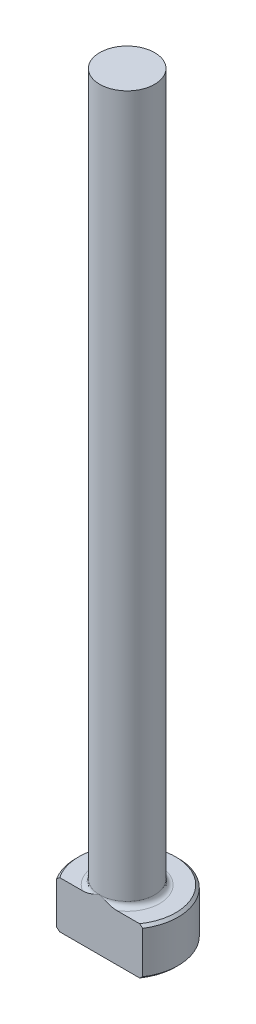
ISO-10303-21;
HEADER;
FILE_DESCRIPTION(('STEP AP214'),'2;1');
FILE_NAME('part.step','',(''),(''),'','','');
FILE_SCHEMA(('AUTOMOTIVE_DESIGN { 1 0 10303 214 1 1 1 1 }'));
ENDSEC;
DATA;
#1=APPLICATION_CONTEXT('core data for automotive mechanical design processes');
#2=APPLICATION_PROTOCOL_DEFINITION('international standard','automotive_design',2000,#1);
#3=PRODUCT_CONTEXT('',#1,'mechanical');
#4=PRODUCT('Part','Part','',(#3));
#5=PRODUCT_RELATED_PRODUCT_CATEGORY('part','',(#4));
#6=PRODUCT_DEFINITION_FORMATION('','',#4);
#7=PRODUCT_DEFINITION_CONTEXT('part definition',#1,'design');
#8=PRODUCT_DEFINITION('design','',#6,#7);
#9=PRODUCT_DEFINITION_SHAPE('','',#8);
#10=(LENGTH_UNIT() NAMED_UNIT(*) SI_UNIT(.MILLI.,.METRE.));
#11=(NAMED_UNIT(*) PLANE_ANGLE_UNIT() SI_UNIT($,.RADIAN.));
#12=(NAMED_UNIT(*) SI_UNIT($,.STERADIAN.) SOLID_ANGLE_UNIT());
#13=UNCERTAINTY_MEASURE_WITH_UNIT(LENGTH_MEASURE(1.E-05),#10,'distance_accuracy_value','');
#14=(GEOMETRIC_REPRESENTATION_CONTEXT(3) GLOBAL_UNCERTAINTY_ASSIGNED_CONTEXT((#13)) GLOBAL_UNIT_ASSIGNED_CONTEXT((#10,
#11,#12)) REPRESENTATION_CONTEXT('',''));
#15=CARTESIAN_POINT('',(0.,0.,0.));
#16=DIRECTION('',(0.,0.,1.));
#17=DIRECTION('',(1.,0.,0.));
#18=AXIS2_PLACEMENT_3D('',#15,#16,#17);
#19=CARTESIAN_POINT('',(0.,0.,0.));
#20=DIRECTION('',(0.,-1.,0.));
#21=DIRECTION('',(0.,0.,-1.));
#22=AXIS2_PLACEMENT_3D('',#19,#20,#21);
#23=PLANE('',#22);
#24=CARTESIAN_POINT('',(0.,0.,0.));
#25=DIRECTION('',(0.,-1.,0.));
#26=DIRECTION('',(0.,0.,-1.));
#27=AXIS2_PLACEMENT_3D('',#24,#25,#26);
#28=CIRCLE('',#27,4.90219999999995);
#29=CARTESIAN_POINT('',(-4.03944478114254,0.,2.77748999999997));
#30=VERTEX_POINT('',#29);
#31=CARTESIAN_POINT('',(4.03944478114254,0.,2.77748999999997));
#32=VERTEX_POINT('',#31);
#33=EDGE_CURVE('E98',#30,#32,#28,.T.);
#34=ORIENTED_EDGE('',*,*,#33,.T.);
#35=DIRECTION('',(-1.,0.,0.));
#36=VECTOR('',#35,1.);
#37=CARTESIAN_POINT('',(-4.34418550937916,0.,2.77748999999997));
#38=LINE('',#37,#36);
#39=EDGE_CURVE('E83',#32,#30,#38,.T.);
#40=ORIENTED_EDGE('',*,*,#39,.T.);
#41=EDGE_LOOP('',(#34,#40));
#42=FACE_BOUND('',#41,.T.);
#43=ADVANCED_FACE('F32',(#42),#23,.T.);
#44=CARTESIAN_POINT('',(0.,259.958771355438,0.));
#45=DIRECTION('',(0.,1.,0.));
#46=DIRECTION('',(0.,0.,1.));
#47=AXIS2_PLACEMENT_3D('',#44,#45,#46);
#48=CYLINDRICAL_SURFACE('',#47,5.15619999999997);
#49=CARTESIAN_POINT('',(0.,4.49579999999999,0.));
#50=DIRECTION('',(0.,1.,0.));
#51=DIRECTION('',(0.,0.,1.));
#52=AXIS2_PLACEMENT_3D('',#49,#50,#51);
#53=CIRCLE('',#52,5.15619999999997);
#54=CARTESIAN_POINT('',(-4.34418550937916,4.49579999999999,2.77748999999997));
#55=VERTEX_POINT('',#54);
#56=CARTESIAN_POINT('',(4.34418550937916,4.49579999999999,2.77748999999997));
#57=VERTEX_POINT('',#56);
#58=EDGE_CURVE('E104',#55,#57,#53,.F.);
#59=ORIENTED_EDGE('',*,*,#58,.T.);
#60=DIRECTION('',(0.,-1.,0.));
#61=VECTOR('',#60,1.);
#62=CARTESIAN_POINT('',(4.34418550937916,76.2,2.77748999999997));
#63=LINE('',#62,#61);
#64=CARTESIAN_POINT('',(4.34418550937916,0.254000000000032,2.77748999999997));
#65=VERTEX_POINT('',#64);
#66=EDGE_CURVE('E183',#57,#65,#63,.T.);
#67=ORIENTED_EDGE('',*,*,#66,.T.);
#68=CARTESIAN_POINT('',(0.,0.254000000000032,0.));
#69=DIRECTION('',(0.,-1.,0.));
#70=DIRECTION('',(0.,0.,-1.));
#71=AXIS2_PLACEMENT_3D('',#68,#69,#70);
#72=CIRCLE('',#71,5.15619999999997);
#73=CARTESIAN_POINT('',(-4.34418550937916,0.254000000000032,2.77748999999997));
#74=VERTEX_POINT('',#73);
#75=EDGE_CURVE('E100',#65,#74,#72,.F.);
#76=ORIENTED_EDGE('',*,*,#75,.T.);
#77=DIRECTION('',(0.,-1.,0.));
#78=VECTOR('',#77,1.);
#79=CARTESIAN_POINT('',(-4.34418550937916,76.2,2.77748999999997));
#80=LINE('',#79,#78);
#81=EDGE_CURVE('E93',#55,#74,#80,.T.);
#82=ORIENTED_EDGE('',*,*,#81,.F.);
#83=EDGE_LOOP('',(#59,#67,#76,#82));
#84=FACE_BOUND('',#83,.T.);
#85=ADVANCED_FACE('F158',(#84),#48,.T.);
#86=CARTESIAN_POINT('',(-5.15619999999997,4.7498,0.));
#87=DIRECTION('',(0.,1.,0.));
#88=DIRECTION('',(0.,0.,1.));
#89=AXIS2_PLACEMENT_3D('',#86,#87,#88);
#90=PLANE('',#89);
#91=CARTESIAN_POINT('',(0.,4.7498,0.));
#92=DIRECTION('',(0.,1.,0.));
#93=DIRECTION('',(0.,0.,1.));
#94=AXIS2_PLACEMENT_3D('',#91,#92,#93);
#95=CIRCLE('',#94,4.90220000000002);
#96=CARTESIAN_POINT('',(4.03944478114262,4.7498,2.77748999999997));
#97=VERTEX_POINT('',#96);
#98=CARTESIAN_POINT('',(-4.03944478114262,4.7498,2.77748999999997));
#99=VERTEX_POINT('',#98);
#100=EDGE_CURVE('E178',#97,#99,#95,.T.);
#101=ORIENTED_EDGE('',*,*,#100,.T.);
#102=DIRECTION('',(1.,0.,0.));
#103=VECTOR('',#102,1.);
#104=CARTESIAN_POINT('',(-5.15619999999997,4.7498,2.77748999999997));
#105=LINE('',#104,#103);
#106=CARTESIAN_POINT('',(-1.75499112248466,4.74979999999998,2.77748999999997));
#107=VERTEX_POINT('',#106);
#108=EDGE_CURVE('E57',#99,#107,#105,.T.);
#109=ORIENTED_EDGE('',*,*,#108,.T.);
#110=CARTESIAN_POINT('',(0.,4.7498,0.));
#111=DIRECTION('',(0.,1.,0.));
#112=DIRECTION('',(0.,0.,1.));
#113=AXIS2_PLACEMENT_3D('',#110,#111,#112);
#114=CIRCLE('',#113,3.28548999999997);
#115=CARTESIAN_POINT('',(1.75499112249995,4.74979999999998,2.77748999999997));
#116=VERTEX_POINT('',#115);
#117=EDGE_CURVE('E107',#107,#116,#114,.F.);
#118=ORIENTED_EDGE('',*,*,#117,.T.);
#119=EDGE_CURVE('E136',#116,#97,#105,.T.);
#120=ORIENTED_EDGE('',*,*,#119,.T.);
#121=EDGE_LOOP('',(#101,#109,#118,#120));
#122=FACE_BOUND('',#121,.T.);
#123=ADVANCED_FACE('F147',(#122),#90,.T.);
#124=CARTESIAN_POINT('',(0.,4.74980000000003,0.));
#125=DIRECTION('',(0.,-1.,0.));
#126=DIRECTION('',(0.,0.,-1.));
#127=AXIS2_PLACEMENT_3D('',#124,#125,#126);
#128=CONICAL_SURFACE('',#127,4.90219999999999,0.785398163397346);
#129=ORIENTED_EDGE('',*,*,#58,.F.);
#130=CARTESIAN_POINT('',(-9.55963531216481,-0.302952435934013,2.77748999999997));
#131=CARTESIAN_POINT('',(-9.37135034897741,-0.122152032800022,2.77748999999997));
#132=CARTESIAN_POINT('',(-9.18286469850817,0.0584399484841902,2.77748999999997));
#133=CARTESIAN_POINT('',(-8.80539641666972,0.419106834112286,2.77748999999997));
#134=CARTESIAN_POINT('',(-8.61641378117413,0.599181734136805,2.77748999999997));
#135=CARTESIAN_POINT('',(-8.23780363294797,0.958763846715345,2.77748999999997));
#136=CARTESIAN_POINT('',(-8.04817594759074,1.13827087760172,2.77748999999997));
#137=CARTESIAN_POINT('',(-7.66820393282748,1.49652400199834,2.77748999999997));
#138=CARTESIAN_POINT('',(-7.47785960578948,1.67527009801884,2.77748999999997));
#139=CARTESIAN_POINT('',(-7.09861750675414,2.02964380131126,2.77748999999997));
#140=CARTESIAN_POINT('',(-6.90973042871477,2.20528284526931,2.77748999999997));
#141=CARTESIAN_POINT('',(-6.53088645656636,2.55540305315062,2.77748999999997));
#142=CARTESIAN_POINT('',(-6.34092956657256,2.72988422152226,2.77748999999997));
#143=CARTESIAN_POINT('',(-5.9596856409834,3.07734070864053,2.77748999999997));
#144=CARTESIAN_POINT('',(-5.76839877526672,3.25031621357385,2.77748999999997));
#145=CARTESIAN_POINT('',(-5.38408554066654,3.59432147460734,2.77748999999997));
#146=CARTESIAN_POINT('',(-5.1910592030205,3.76535126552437,2.77748999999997));
#147=CARTESIAN_POINT('',(-4.84259460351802,4.06992471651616,2.77748999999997));
#148=CARTESIAN_POINT('',(-4.68757975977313,4.20395211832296,2.77748999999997));
#149=CARTESIAN_POINT('',(-4.37569692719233,4.4698650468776,2.77748999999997));
#150=CARTESIAN_POINT('',(-4.2188287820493,4.60175039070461,2.77748999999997));
#151=CARTESIAN_POINT('',(-3.90151974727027,4.86365914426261,2.77748999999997));
#152=CARTESIAN_POINT('',(-3.74106073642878,4.99366069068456,2.77748999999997));
#153=CARTESIAN_POINT('',(-3.41702456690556,5.24965567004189,2.77748999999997));
#154=CARTESIAN_POINT('',(-3.25344811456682,5.37564999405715,2.77748999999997));
#155=CARTESIAN_POINT('',(-2.92018078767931,5.62344221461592,2.77748999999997));
#156=CARTESIAN_POINT('',(-2.75044139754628,5.74517569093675,2.77748999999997));
#157=CARTESIAN_POINT('',(-2.49133655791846,5.92141891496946,2.77748999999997));
#158=CARTESIAN_POINT('',(-2.40416054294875,5.97914279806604,2.77748999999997));
#159=CARTESIAN_POINT('',(-2.22809424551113,6.09190571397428,2.77748999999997));
#160=CARTESIAN_POINT('',(-2.13920410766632,6.14694497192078,2.77748999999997));
#161=CARTESIAN_POINT('',(-1.96016003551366,6.25324529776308,2.77748999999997));
#162=CARTESIAN_POINT('',(-1.8700225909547,6.3045338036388,2.77748999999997));
#163=CARTESIAN_POINT('',(-1.68751963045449,6.40295882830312,2.77748999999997));
#164=CARTESIAN_POINT('',(-1.59515373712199,6.45009463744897,2.77748999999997));
#165=CARTESIAN_POINT('',(-1.31465582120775,6.58349576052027,2.77748999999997));
#166=CARTESIAN_POINT('',(-1.12257968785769,6.66209225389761,2.77748999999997));
#167=CARTESIAN_POINT('',(-0.832011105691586,6.75391692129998,2.77748999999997));
#168=CARTESIAN_POINT('',(-0.737496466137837,6.77977348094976,2.77748999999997));
#169=CARTESIAN_POINT('',(-0.546475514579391,6.82278925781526,2.77748999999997));
#170=CARTESIAN_POINT('',(-0.44996950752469,6.83994979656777,2.77748999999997));
#171=CARTESIAN_POINT('',(-0.256218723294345,6.86436233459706,2.77748999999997));
#172=CARTESIAN_POINT('',(-0.158980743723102,6.87166730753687,2.77748999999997));
#173=CARTESIAN_POINT('',(0.0357279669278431,6.87598550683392,2.77748999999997));
#174=CARTESIAN_POINT('',(0.133198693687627,6.87299892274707,2.77748999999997));
#175=CARTESIAN_POINT('',(0.326944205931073,6.85699585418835,2.77748999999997));
#176=CARTESIAN_POINT('',(0.423222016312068,6.84401516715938,2.77748999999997));
#177=CARTESIAN_POINT('',(0.614119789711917,6.8089777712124,2.77748999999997));
#178=CARTESIAN_POINT('',(0.708739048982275,6.78691730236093,2.77748999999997));
#179=CARTESIAN_POINT('',(0.896435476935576,6.73483507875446,2.77748999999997));
#180=CARTESIAN_POINT('',(0.989497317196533,6.70475895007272,2.77748999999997));
#181=CARTESIAN_POINT('',(1.17322201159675,6.63810376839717,2.77748999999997));
#182=CARTESIAN_POINT('',(1.26388499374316,6.60152506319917,2.77748999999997));
#183=CARTESIAN_POINT('',(1.47746511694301,6.50797532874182,2.77748999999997));
#184=CARTESIAN_POINT('',(1.59931597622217,6.44858460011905,2.77748999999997));
#185=CARTESIAN_POINT('',(1.83913088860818,6.3223671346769,2.77748999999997));
#186=CARTESIAN_POINT('',(1.95709243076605,6.25553571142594,2.77748999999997));
#187=CARTESIAN_POINT('',(2.18997865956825,6.11622068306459,2.77748999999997));
#188=CARTESIAN_POINT('',(2.30489556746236,6.04372417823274,2.77748999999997));
#189=CARTESIAN_POINT('',(2.53196606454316,5.89460998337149,2.77748999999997));
#190=CARTESIAN_POINT('',(2.64412028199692,5.81799324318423,2.77748999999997));
#191=CARTESIAN_POINT('',(2.86729042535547,5.66082623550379,2.77748999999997));
#192=CARTESIAN_POINT('',(2.97828414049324,5.5802445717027,2.77748999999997));
#193=CARTESIAN_POINT('',(3.19840564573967,5.41657181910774,2.77748999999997));
#194=CARTESIAN_POINT('',(3.30753335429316,5.33348062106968,2.77748999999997));
#195=CARTESIAN_POINT('',(3.63230478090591,5.08151517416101,2.77748999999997));
#196=CARTESIAN_POINT('',(3.84567050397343,4.90970900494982,2.77748999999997));
#197=CARTESIAN_POINT('',(4.30277208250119,4.53251833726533,2.77748999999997));
#198=CARTESIAN_POINT('',(4.54576364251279,4.32624002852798,2.77748999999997));
#199=CARTESIAN_POINT('',(5.0278968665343,3.90921091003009,2.77748999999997));
#200=CARTESIAN_POINT('',(5.26703820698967,3.69845972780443,2.77748999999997));
#201=CARTESIAN_POINT('',(5.74277905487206,3.27371644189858,2.77748999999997));
#202=CARTESIAN_POINT('',(5.97937625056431,3.0597217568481,2.77748999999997));
#203=CARTESIAN_POINT('',(6.45056510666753,2.62953458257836,2.77748999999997));
#204=CARTESIAN_POINT('',(6.68515674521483,2.41334206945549,2.77748999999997));
#205=CARTESIAN_POINT('',(7.14123520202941,1.99009092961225,2.77748999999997));
#206=CARTESIAN_POINT('',(7.36279506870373,1.78311090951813,2.77748999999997));
#207=CARTESIAN_POINT('',(7.80485250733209,1.36801517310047,2.77748999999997));
#208=CARTESIAN_POINT('',(8.02535006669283,1.15989944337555,2.77748999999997));
#209=CARTESIAN_POINT('',(8.46520134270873,0.743063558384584,2.77748999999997));
#210=CARTESIAN_POINT('',(8.68455621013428,0.534344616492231,2.77748999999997));
#211=CARTESIAN_POINT('',(9.12257454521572,0.116191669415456,2.77748999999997));
#212=CARTESIAN_POINT('',(9.34123802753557,-0.0932423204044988,2.77748999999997));
#213=CARTESIAN_POINT('',(9.55963531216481,-0.302952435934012,2.77748999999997));
#214=B_SPLINE_CURVE_WITH_KNOTS('',3,(#130,#131,#132,#133,#134,#135,#136,#137,#138,#139,#140,
#141,#142,#143,#144,#145,#146,#147,#148,#149,#150,#151,#152,#153,#154,#155,#156,#157,#158,#159,
#160,#161,#162,#163,#164,#165,#166,#167,#168,#169,#170,#171,#172,#173,#174,#175,#176,#177,#178,
#179,#180,#181,#182,#183,#184,#185,#186,#187,#188,#189,#190,#191,#192,#193,#194,#195,#196,#197,
#198,#199,#200,#201,#202,#203,#204,#205,#206,#207,#208,#209,#210,#211,#212,#213),.UNSPECIFIED.,
.F.,.F.,(4,2,2,2,2,2,2,2,2,2,2,2,2,2,2,2,2,2,2,2,2,2,2,2,2,2,2,2,2,2,2,2,2,2,2,2,2,2,2,2,2,4),
(0.,0.783109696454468,1.56622591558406,2.34957144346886,3.13291438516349,3.90669782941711,
4.68047829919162,5.45416168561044,6.2278312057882,6.84258177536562,7.45738456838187,
8.07687494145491,8.69622658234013,9.32265693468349,9.63628229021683,9.94988129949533,
10.260891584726,10.5719549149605,11.1921677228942,11.4858060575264,11.7793997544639,
12.0714090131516,12.3634128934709,12.6543756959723,12.9454591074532,13.2385696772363,
13.5316645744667,13.9379559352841,14.3445046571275,14.7520077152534,15.1594172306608,
15.570853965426,15.9823086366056,16.8039855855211,17.760133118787,18.716360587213,
19.6733938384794,20.6304375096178,21.540028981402,22.4496312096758,23.3579913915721,
24.2663321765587),.UNSPECIFIED.);
#215=EDGE_CURVE('E135',#55,#99,#214,.T.);
#216=ORIENTED_EDGE('',*,*,#215,.T.);
#217=ORIENTED_EDGE('',*,*,#100,.F.);
#218=EDGE_CURVE('E127',#97,#57,#214,.T.);
#219=ORIENTED_EDGE('',*,*,#218,.T.);
#220=EDGE_LOOP('',(#129,#216,#217,#219));
#221=FACE_BOUND('',#220,.T.);
#222=ADVANCED_FACE('F143',(#221),#128,.T.);
#223=CARTESIAN_POINT('',(0.,0.254000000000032,0.));
#224=DIRECTION('',(0.,1.,0.));
#225=DIRECTION('',(0.,0.,1.));
#226=AXIS2_PLACEMENT_3D('',#223,#224,#225);
#227=CONICAL_SURFACE('',#226,5.15619999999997,0.785398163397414);
#228=ORIENTED_EDGE('',*,*,#75,.F.);
#229=CARTESIAN_POINT('',(9.55963531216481,5.05275243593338,2.77748999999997));
#230=CARTESIAN_POINT('',(9.37135034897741,4.87195203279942,2.77748999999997));
#231=CARTESIAN_POINT('',(9.18286469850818,4.69136005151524,2.77748999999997));
#232=CARTESIAN_POINT('',(8.80539641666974,4.3306931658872,2.77748999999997));
#233=CARTESIAN_POINT('',(8.61641378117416,4.15061826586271,2.77748999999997));
#234=CARTESIAN_POINT('',(8.237803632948,3.79103615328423,2.77748999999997));
#235=CARTESIAN_POINT('',(8.04817594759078,3.61152912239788,2.77748999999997));
#236=CARTESIAN_POINT('',(7.66820393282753,3.25327599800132,2.77748999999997));
#237=CARTESIAN_POINT('',(7.47785960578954,3.07452990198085,2.77748999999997));
#238=CARTESIAN_POINT('',(7.09861750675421,2.72015619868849,2.77748999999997));
#239=CARTESIAN_POINT('',(6.90973042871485,2.54451715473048,2.77748999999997));
#240=CARTESIAN_POINT('',(6.53088645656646,2.19439694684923,2.77748999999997));
#241=CARTESIAN_POINT('',(6.34092956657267,2.01991577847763,2.77748999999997));
#242=CARTESIAN_POINT('',(5.95968564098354,1.67245929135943,2.77748999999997));
#243=CARTESIAN_POINT('',(5.76839877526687,1.49948378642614,2.77748999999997));
#244=CARTESIAN_POINT('',(5.38408554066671,1.15547852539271,2.77748999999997));
#245=CARTESIAN_POINT('',(5.19105920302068,0.98444873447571,2.77748999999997));
#246=CARTESIAN_POINT('',(4.84259460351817,0.679875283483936,2.77748999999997));
#247=CARTESIAN_POINT('',(4.68757975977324,0.545847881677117,2.77748999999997));
#248=CARTESIAN_POINT('',(4.37569692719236,0.279934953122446,2.77748999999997));
#249=CARTESIAN_POINT('',(4.21882878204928,0.148049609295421,2.77748999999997));
#250=CARTESIAN_POINT('',(3.90151974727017,-0.113859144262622,2.77748999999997));
#251=CARTESIAN_POINT('',(3.74106073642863,-0.243860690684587,2.77748999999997));
#252=CARTESIAN_POINT('',(3.41702456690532,-0.499855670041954,2.77748999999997));
#253=CARTESIAN_POINT('',(3.25344811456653,-0.625849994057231,2.77748999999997));
#254=CARTESIAN_POINT('',(2.92018078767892,-0.87364221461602,2.77748999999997));
#255=CARTESIAN_POINT('',(2.75044139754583,-0.995375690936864,2.77748999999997));
#256=CARTESIAN_POINT('',(2.49133655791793,-1.17161891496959,2.77748999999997));
#257=CARTESIAN_POINT('',(2.40416054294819,-1.22934279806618,2.77748999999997));
#258=CARTESIAN_POINT('',(2.22809424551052,-1.34210571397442,2.77748999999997));
#259=CARTESIAN_POINT('',(2.13920410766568,-1.39714497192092,2.77748999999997));
#260=CARTESIAN_POINT('',(1.96016003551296,-1.50344529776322,2.77748999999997));
#261=CARTESIAN_POINT('',(1.87002259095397,-1.55473380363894,2.77748999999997));
#262=CARTESIAN_POINT('',(1.6875196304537,-1.65315882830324,2.77748999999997));
#263=CARTESIAN_POINT('',(1.59515373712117,-1.70029463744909,2.77748999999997));
#264=CARTESIAN_POINT('',(1.31465582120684,-1.83369576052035,2.77748999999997));
#265=CARTESIAN_POINT('',(1.12257968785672,-1.91229225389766,2.77748999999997));
#266=CARTESIAN_POINT('',(0.832011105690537,-2.00411692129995,2.77748999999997));
#267=CARTESIAN_POINT('',(0.73749646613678,-2.02997348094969,2.77748999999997));
#268=CARTESIAN_POINT('',(0.546475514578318,-2.07298925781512,2.77748999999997));
#269=CARTESIAN_POINT('',(0.449969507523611,-2.0901497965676,2.77748999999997));
#270=CARTESIAN_POINT('',(0.256218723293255,-2.11456233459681,2.77748999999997));
#271=CARTESIAN_POINT('',(0.158980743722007,-2.12186730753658,2.77748999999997));
#272=CARTESIAN_POINT('',(-0.0357279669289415,-2.12618550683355,2.77748999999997));
#273=CARTESIAN_POINT('',(-0.133198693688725,-2.12319892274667,2.77748999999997));
#274=CARTESIAN_POINT('',(-0.326944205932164,-2.10719585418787,2.77748999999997));
#275=CARTESIAN_POINT('',(-0.423222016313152,-2.09421516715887,2.77748999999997));
#276=CARTESIAN_POINT('',(-0.614119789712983,-2.05917777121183,2.77748999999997));
#277=CARTESIAN_POINT('',(-0.708739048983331,-2.03711730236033,2.77748999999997));
#278=CARTESIAN_POINT('',(-0.896435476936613,-1.98503507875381,2.77748999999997));
#279=CARTESIAN_POINT('',(-0.98949731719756,-1.95495895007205,2.77748999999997));
#280=CARTESIAN_POINT('',(-1.17322201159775,-1.88830376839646,2.77748999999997));
#281=CARTESIAN_POINT('',(-1.26388499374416,-1.85172506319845,2.77748999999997));
#282=CARTESIAN_POINT('',(-1.47746511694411,-1.758175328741,2.77748999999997));
#283=CARTESIAN_POINT('',(-1.5993159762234,-1.69878460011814,2.77748999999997));
#284=CARTESIAN_POINT('',(-1.83913088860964,-1.57256713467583,2.77748999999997));
#285=CARTESIAN_POINT('',(-1.95709243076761,-1.50573571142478,2.77748999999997));
#286=CARTESIAN_POINT('',(-2.18997865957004,-1.36642068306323,2.77748999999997));
#287=CARTESIAN_POINT('',(-2.30489556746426,-1.29392417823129,2.77748999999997));
#288=CARTESIAN_POINT('',(-2.53196606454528,-1.14480998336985,2.77748999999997));
#289=CARTESIAN_POINT('',(-2.64412028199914,-1.06819324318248,2.77748999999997));
#290=CARTESIAN_POINT('',(-2.86729042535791,-0.911026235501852,2.77748999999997));
#291=CARTESIAN_POINT('',(-2.97828414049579,-0.83044457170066,2.77748999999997));
#292=CARTESIAN_POINT('',(-3.19840564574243,-0.66677181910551,2.77748999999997));
#293=CARTESIAN_POINT('',(-3.30753335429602,-0.583680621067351,2.77748999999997));
#294=CARTESIAN_POINT('',(-3.63230478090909,-0.331715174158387,2.77748999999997));
#295=CARTESIAN_POINT('',(-3.84567050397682,-0.159909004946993,2.77748999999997));
#296=CARTESIAN_POINT('',(-4.30277208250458,0.217281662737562,2.77748999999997));
#297=CARTESIAN_POINT('',(-4.54576364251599,0.423559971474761,2.77748999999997));
#298=CARTESIAN_POINT('',(-5.02789686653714,0.840589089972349,2.77748999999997));
#299=CARTESIAN_POINT('',(-5.26703820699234,1.05134027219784,2.77748999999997));
#300=CARTESIAN_POINT('',(-5.74277905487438,1.47608355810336,2.77748999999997));
#301=CARTESIAN_POINT('',(-5.97937625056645,1.69007824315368,2.77748999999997));
#302=CARTESIAN_POINT('',(-6.45056510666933,2.12026541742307,2.77748999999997));
#303=CARTESIAN_POINT('',(-6.68515674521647,2.33645793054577,2.77748999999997));
#304=CARTESIAN_POINT('',(-7.14123520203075,2.7597090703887,2.77748999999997));
#305=CARTESIAN_POINT('',(-7.36279506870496,2.96668909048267,2.77748999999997));
#306=CARTESIAN_POINT('',(-7.80485250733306,3.38178482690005,2.77748999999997));
#307=CARTESIAN_POINT('',(-8.02535006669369,3.58990055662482,2.77748999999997));
#308=CARTESIAN_POINT('',(-8.46520134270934,4.00673644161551,2.77748999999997));
#309=CARTESIAN_POINT('',(-8.68455621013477,4.21545538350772,2.77748999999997));
#310=CARTESIAN_POINT('',(-9.12257454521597,4.63360833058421,2.77748999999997));
#311=CARTESIAN_POINT('',(-9.3412380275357,4.84304232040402,2.77748999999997));
#312=CARTESIAN_POINT('',(-9.55963531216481,5.05275243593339,2.77748999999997));
#313=B_SPLINE_CURVE_WITH_KNOTS('',3,(#229,#230,#231,#232,#233,#234,#235,#236,#237,#238,#239,
#240,#241,#242,#243,#244,#245,#246,#247,#248,#249,#250,#251,#252,#253,#254,#255,#256,#257,#258,
#259,#260,#261,#262,#263,#264,#265,#266,#267,#268,#269,#270,#271,#272,#273,#274,#275,#276,#277,
#278,#279,#280,#281,#282,#283,#284,#285,#286,#287,#288,#289,#290,#291,#292,#293,#294,#295,#296,
#297,#298,#299,#300,#301,#302,#303,#304,#305,#306,#307,#308,#309,#310,#311,#312),.UNSPECIFIED.,
.F.,.F.,(4,2,2,2,2,2,2,2,2,2,2,2,2,2,2,2,2,2,2,2,2,2,2,2,2,2,2,2,2,2,2,2,2,2,2,2,2,2,2,2,2,4),
(0.,0.783109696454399,1.56622591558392,2.34957144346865,3.13291438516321,3.90669782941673,
4.68047829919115,5.45416168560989,6.22783120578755,6.8425817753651,7.45738456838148,
8.07687494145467,8.69622658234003,9.32265693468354,9.63628229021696,9.94988129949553,
10.2608915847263,10.5719549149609,11.1921677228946,11.4858060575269,11.7793997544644,
12.0714090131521,12.3634128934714,12.6543756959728,12.9454591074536,13.2385696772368,
13.5316645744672,13.9379559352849,14.3445046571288,14.7520077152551,15.159417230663,
15.5708539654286,15.9823086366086,16.803985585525,17.7601331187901,18.7163605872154,
19.6733938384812,20.6304375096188,21.5400289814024,22.4496312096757,23.3579913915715,
24.2663321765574),.UNSPECIFIED.);
#314=EDGE_CURVE('E86',#65,#32,#313,.T.);
#315=ORIENTED_EDGE('',*,*,#314,.T.);
#316=ORIENTED_EDGE('',*,*,#33,.F.);
#317=EDGE_CURVE('E89',#30,#74,#313,.T.);
#318=ORIENTED_EDGE('',*,*,#317,.T.);
#319=EDGE_LOOP('',(#228,#315,#316,#318));
#320=FACE_BOUND('',#319,.T.);
#321=ADVANCED_FACE('F97',(#320),#227,.T.);
#322=CARTESIAN_POINT('',(0.,5.25779999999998,0.));
#323=DIRECTION('',(0.,1.,0.));
#324=DIRECTION('',(0.,0.,1.));
#325=AXIS2_PLACEMENT_3D('',#322,#323,#324);
#326=TOROIDAL_SURFACE('',#325,3.28548999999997,0.508);
#327=CARTESIAN_POINT('',(0.,5.25779999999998,2.77748999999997));
#328=CARTESIAN_POINT('',(-3.63482500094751E-11,5.25780081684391,2.77748999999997));
#329=CARTESIAN_POINT('',(1.58527088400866E-07,5.25780163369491,2.77748999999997));
#330=CARTESIAN_POINT('',(6.68759389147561E-07,5.2578032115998,2.77748999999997));
#331=CARTESIAN_POINT('',(1.02470275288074E-06,5.2578039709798,2.77748999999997));
#332=CARTESIAN_POINT('',(1.88230728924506E-06,5.25780548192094,2.77748999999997));
#333=CARTESIAN_POINT('',(2.39329363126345E-06,5.25780622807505,2.77748999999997));
#334=CARTESIAN_POINT('',(3.50054720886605E-06,5.25780764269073,2.77748999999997));
#335=CARTESIAN_POINT('',(4.09620351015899E-06,5.25780831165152,2.77748999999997));
#336=CARTESIAN_POINT('',(6.21505862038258E-06,5.25781052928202,2.77748999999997));
#337=CARTESIAN_POINT('',(7.84997964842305E-06,5.25781197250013,2.77748999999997));
#338=CARTESIAN_POINT('',(1.12461435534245E-05,5.25781456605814,2.77748999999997));
#339=CARTESIAN_POINT('',(1.30017650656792E-05,5.25781572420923,2.77748999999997));
#340=CARTESIAN_POINT('',(1.97830813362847E-05,5.25782001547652,2.77748999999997));
#341=CARTESIAN_POINT('',(2.49606936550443E-05,5.25782291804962,2.77748999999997));
#342=CARTESIAN_POINT('',(3.52264964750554E-05,5.25782772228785,2.77748999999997));
#343=CARTESIAN_POINT('',(4.02861099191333E-05,5.25782968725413,2.77748999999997));
#344=CARTESIAN_POINT('',(6.16428547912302E-05,5.25783793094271,2.77748999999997));
#345=CARTESIAN_POINT('',(7.79686338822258E-05,5.25784410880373,2.77748999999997));
#346=CARTESIAN_POINT('',(0.000108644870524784,5.2578541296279,2.77748999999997));
#347=CARTESIAN_POINT('',(0.000122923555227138,5.25785818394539,2.77748999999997));
#348=CARTESIAN_POINT('',(0.00022589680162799,5.25789001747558,2.77748999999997));
#349=CARTESIAN_POINT('',(0.000310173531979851,5.25793021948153,2.77748999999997));
#350=CARTESIAN_POINT('',(0.000636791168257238,5.25808026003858,2.77748999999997));
#351=CARTESIAN_POINT('',(0.00088220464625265,5.25818086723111,2.77748999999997));
#352=CARTESIAN_POINT('',(0.00183112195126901,5.25857573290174,2.77748999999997));
#353=CARTESIAN_POINT('',(0.00253146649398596,5.25887966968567,2.77748999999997));
#354=CARTESIAN_POINT('',(0.00538269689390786,5.26011107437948,2.77748999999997));
#355=CARTESIAN_POINT('',(0.00753706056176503,5.2610276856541,2.77748999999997));
#356=CARTESIAN_POINT('',(0.0523267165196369,5.2800917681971,2.77748999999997));
#357=CARTESIAN_POINT('',(0.0949226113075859,5.29836433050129,2.77748999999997));
#358=CARTESIAN_POINT('',(0.178660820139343,5.33400805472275,2.77748999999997));
#359=CARTESIAN_POINT('',(0.219799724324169,5.35138784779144,2.77748999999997));
#360=CARTESIAN_POINT('',(0.30692560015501,5.38783884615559,2.77748999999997));
#361=CARTESIAN_POINT('',(0.352927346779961,5.40687537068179,2.77748999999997));
#362=CARTESIAN_POINT('',(0.445632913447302,5.44454742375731,2.77748999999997));
#363=CARTESIAN_POINT('',(0.492339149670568,5.46317702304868,2.77748999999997));
#364=CARTESIAN_POINT('',(0.574123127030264,5.4949722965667,2.77748999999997));
#365=CARTESIAN_POINT('',(0.609129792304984,5.50832012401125,2.77748999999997));
#366=CARTESIAN_POINT('',(0.679265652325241,5.53442851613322,2.77748999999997));
#367=CARTESIAN_POINT('',(0.714394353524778,5.54719040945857,2.77748999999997));
#368=CARTESIAN_POINT('',(0.818611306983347,5.58395598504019,2.77748999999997));
#369=CARTESIAN_POINT('',(0.888033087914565,5.60703279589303,2.77748999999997));
#370=CARTESIAN_POINT('',(1.01885178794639,5.64701930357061,2.77748999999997));
#371=CARTESIAN_POINT('',(1.0801217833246,5.66434067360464,2.77748999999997));
#372=CARTESIAN_POINT('',(1.20389830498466,5.69582437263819,2.77748999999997));
#373=CARTESIAN_POINT('',(1.26641022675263,5.70996583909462,2.77748999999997));
#374=CARTESIAN_POINT('',(1.39563114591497,5.73475443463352,2.77748999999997));
#375=CARTESIAN_POINT('',(1.46238514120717,5.74517289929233,2.77748999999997));
#376=CARTESIAN_POINT('',(1.5964208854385,5.76016238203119,2.77748999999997));
#377=CARTESIAN_POINT('',(1.6637008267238,5.76474842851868,2.77748999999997));
#378=CARTESIAN_POINT('',(1.78334896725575,5.76633336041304,2.77748999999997));
#379=CARTESIAN_POINT('',(1.83569286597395,5.76479753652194,2.77748999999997));
#380=CARTESIAN_POINT('',(1.93953534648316,5.75634035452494,2.77748999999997));
#381=CARTESIAN_POINT('',(1.99103732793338,5.74946529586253,2.77748999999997));
#382=CARTESIAN_POINT('',(2.09352832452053,5.72907082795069,2.77748999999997));
#383=CARTESIAN_POINT('',(2.14449935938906,5.71545744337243,2.77748999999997));
#384=CARTESIAN_POINT('',(2.2436267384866,5.67996337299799,2.77748999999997));
#385=CARTESIAN_POINT('',(2.29178599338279,5.65809141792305,2.77748999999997));
#386=CARTESIAN_POINT('',(2.36178980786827,5.61652411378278,2.77748999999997));
#387=CARTESIAN_POINT('',(2.38569818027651,5.60030457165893,2.77748999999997));
#388=CARTESIAN_POINT('',(2.4309629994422,5.56461281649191,2.77748999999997));
#389=CARTESIAN_POINT('',(2.45232270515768,5.54514483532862,2.77748999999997));
#390=CARTESIAN_POINT('',(2.48830742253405,5.50626208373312,2.77748999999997));
#391=CARTESIAN_POINT('',(2.50346308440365,5.48734205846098,2.77748999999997));
#392=CARTESIAN_POINT('',(2.53047517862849,5.44726495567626,2.77748999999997));
#393=CARTESIAN_POINT('',(2.5423352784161,5.42611040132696,2.77748999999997));
#394=CARTESIAN_POINT('',(2.56038418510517,5.3854866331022,2.77748999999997));
#395=CARTESIAN_POINT('',(2.56717564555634,5.36628626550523,2.77748999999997));
#396=CARTESIAN_POINT('',(2.57744003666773,5.32701469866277,2.77748999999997));
#397=CARTESIAN_POINT('',(2.58091477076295,5.30694397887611,2.77748999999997));
#398=CARTESIAN_POINT('',(2.58430568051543,5.2664504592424,2.77748999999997));
#399=CARTESIAN_POINT('',(2.584213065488,5.24602691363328,2.77748999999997));
#400=CARTESIAN_POINT('',(2.5804545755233,5.20551288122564,2.77748999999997));
#401=CARTESIAN_POINT('',(2.57678819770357,5.18542244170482,2.77748999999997));
#402=CARTESIAN_POINT('',(2.56632842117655,5.14683425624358,2.77748999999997));
#403=CARTESIAN_POINT('',(2.55964787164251,5.12830543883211,2.77748999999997));
#404=CARTESIAN_POINT('',(2.54358717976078,5.09246829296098,2.77748999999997));
#405=CARTESIAN_POINT('',(2.53420613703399,5.07516037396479,2.77748999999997));
#406=CARTESIAN_POINT('',(2.50902920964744,5.03545005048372,2.77748999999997));
#407=CARTESIAN_POINT('',(2.49216203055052,5.01372616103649,2.77748999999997));
#408=CARTESIAN_POINT('',(2.45513239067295,4.97328752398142,2.77748999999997));
#409=CARTESIAN_POINT('',(2.43496232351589,4.95457992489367,2.77748999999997));
#410=CARTESIAN_POINT('',(2.38311067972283,4.912743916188,2.77748999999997));
#411=CARTESIAN_POINT('',(2.35019661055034,4.89114952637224,2.77748999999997));
#412=CARTESIAN_POINT('',(2.28149859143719,4.85339659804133,2.77748999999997));
#413=CARTESIAN_POINT('',(2.24571462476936,4.83723809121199,2.77748999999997));
#414=CARTESIAN_POINT('',(2.15091163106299,4.80145440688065,2.77748999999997));
#415=CARTESIAN_POINT('',(2.09057342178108,4.7853535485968,2.77748999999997));
#416=CARTESIAN_POINT('',(1.96762393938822,4.76220444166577,2.77748999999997));
#417=CARTESIAN_POINT('',(1.90499415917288,4.75526622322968,2.77748999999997));
#418=CARTESIAN_POINT('',(1.78440975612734,4.74902507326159,2.77748999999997));
#419=CARTESIAN_POINT('',(1.72647978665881,4.74915837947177,2.77748999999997));
#420=CARTESIAN_POINT('',(1.61075698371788,4.75449180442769,2.77748999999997));
#421=CARTESIAN_POINT('',(1.55296472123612,4.75970292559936,2.77748999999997));
#422=CARTESIAN_POINT('',(1.44056033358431,4.77392629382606,2.77748999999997));
#423=CARTESIAN_POINT('',(1.38592386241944,4.78275336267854,2.77748999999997));
#424=CARTESIAN_POINT('',(1.27754428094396,4.8034547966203,2.77748999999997));
#425=CARTESIAN_POINT('',(1.22379796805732,4.81531273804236,2.77748999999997));
#426=CARTESIAN_POINT('',(1.08372355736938,4.84970148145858,2.77748999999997));
#427=CARTESIAN_POINT('',(0.997900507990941,4.87428584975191,2.77748999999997));
#428=CARTESIAN_POINT('',(0.869412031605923,4.91500035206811,2.77748999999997));
#429=CARTESIAN_POINT('',(0.826169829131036,4.9293839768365,2.77748999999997));
#430=CARTESIAN_POINT('',(0.739936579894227,4.95921802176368,2.77748999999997));
#431=CARTESIAN_POINT('',(0.696946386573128,4.97467092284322,2.77748999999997));
#432=CARTESIAN_POINT('',(0.59684372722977,5.0117644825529,2.77748999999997));
#433=CARTESIAN_POINT('',(0.539854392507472,5.03373544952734,2.77748999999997));
#434=CARTESIAN_POINT('',(0.426869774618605,5.07852412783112,2.77748999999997));
#435=CARTESIAN_POINT('',(0.370870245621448,5.1013312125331,2.77748999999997));
#436=CARTESIAN_POINT('',(0.264915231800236,5.14523941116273,2.77748999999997));
#437=CARTESIAN_POINT('',(0.214932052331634,5.16627387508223,2.77748999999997));
#438=CARTESIAN_POINT('',(0.138912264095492,5.19849280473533,2.77748999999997));
#439=CARTESIAN_POINT('',(0.112835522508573,5.20958556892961,2.77748999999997));
#440=CARTESIAN_POINT('',(0.061077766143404,5.23169621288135,2.77748999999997));
#441=CARTESIAN_POINT('',(0.0353963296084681,5.24271296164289,2.77748999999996));
#442=CARTESIAN_POINT('',(0.00753653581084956,5.25457265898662,2.77748999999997));
#443=CARTESIAN_POINT('',(0.00538158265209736,5.25548941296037,2.77748999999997));
#444=CARTESIAN_POINT('',(0.00253020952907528,5.25672086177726,2.77748999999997));
#445=CARTESIAN_POINT('',(0.00183028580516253,5.25702462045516,2.77748999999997));
#446=CARTESIAN_POINT('',(0.000881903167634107,5.25741926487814,2.77748999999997));
#447=CARTESIAN_POINT('',(0.000636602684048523,5.25751982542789,2.77748999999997));
#448=CARTESIAN_POINT('',(0.000310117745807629,5.25766980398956,2.77748999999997));
#449=CARTESIAN_POINT('',(0.00022586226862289,5.2577099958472,2.77748999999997));
#450=CARTESIAN_POINT('',(0.000122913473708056,5.25774182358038,2.77748999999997));
#451=CARTESIAN_POINT('',(0.000108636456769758,5.25774587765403,2.77748999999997));
#452=CARTESIAN_POINT('',(7.79638534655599E-05,5.25775589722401,2.77748999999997));
#453=CARTESIAN_POINT('',(6.16399948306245E-05,5.25776207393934,2.77748999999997));
#454=CARTESIAN_POINT('',(4.02854070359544E-05,5.2577703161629,2.77748999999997));
#455=CARTESIAN_POINT('',(3.52260605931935E-05,5.25777228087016,2.77748999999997));
#456=CARTESIAN_POINT('',(2.49607548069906E-05,5.25777708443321,2.77748999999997));
#457=CARTESIAN_POINT('',(1.97833634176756E-05,5.25777998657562,2.77748999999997));
#458=CARTESIAN_POINT('',(1.30022515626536E-05,5.25778427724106,2.77748999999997));
#459=CARTESIAN_POINT('',(1.12466510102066E-05,5.25778543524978,2.77748999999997));
#460=CARTESIAN_POINT('',(7.85050041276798E-06,5.25778802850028,2.77748999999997));
#461=CARTESIAN_POINT('',(6.21557048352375E-06,5.25778947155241,2.77748999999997));
#462=CARTESIAN_POINT('',(4.0966688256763E-06,5.25779168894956,2.77748999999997));
#463=CARTESIAN_POINT('',(3.500992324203E-06,5.25779235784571,2.77748999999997));
#464=CARTESIAN_POINT('',(2.3936868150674E-06,5.25779377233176,2.77748999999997));
#465=CARTESIAN_POINT('',(1.88266863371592E-06,5.25779451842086,2.77748999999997));
#466=CARTESIAN_POINT('',(1.02498698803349E-06,5.25779602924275,2.77748999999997));
#467=CARTESIAN_POINT('',(6.6899975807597E-07,5.25779678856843,2.77748999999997));
#468=CARTESIAN_POINT('',(1.58661369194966E-07,5.25779836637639,2.77748999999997));
#469=CARTESIAN_POINT('',(3.63469769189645E-11,5.25779918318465,2.77748999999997));
#470=CARTESIAN_POINT('',(0.,5.25779999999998,2.77748999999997));
#471=B_SPLINE_CURVE_WITH_KNOTS('',3,(#327,#328,#329,#330,#331,#332,#333,#334,#335,#336,#337,
#338,#339,#340,#341,#342,#343,#344,#345,#346,#347,#348,#349,#350,#351,#352,#353,#354,#355,#356,
#357,#358,#359,#360,#361,#362,#363,#364,#365,#366,#367,#368,#369,#370,#371,#372,#373,#374,#375,
#376,#377,#378,#379,#380,#381,#382,#383,#384,#385,#386,#387,#388,#389,#390,#391,#392,#393,#394,
#395,#396,#397,#398,#399,#400,#401,#402,#403,#404,#405,#406,#407,#408,#409,#410,#411,#412,#413,
#414,#415,#416,#417,#418,#419,#420,#421,#422,#423,#424,#425,#426,#427,#428,#429,#430,#431,#432,
#433,#434,#435,#436,#437,#438,#439,#440,#441,#442,#443,#444,#445,#446,#447,#448,#449,#450,#451,
#452,#453,#454,#455,#456,#457,#458,#459,#460,#461,#462,#463,#464,#465,#466,#467,#468,#469,#470),
.UNSPECIFIED.,.T.,.F.,(4,2,2,2,2,2,2,2,2,2,2,2,2,2,2,2,2,2,2,2,2,2,2,2,2,2,2,2,2,2,2,2,2,2,2,2,
2,2,2,2,2,2,2,2,2,2,2,2,2,2,2,2,2,2,2,2,2,2,2,2,2,2,2,2,2,2,2,2,2,2,2,4),(0.,
2.44855601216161E-06,4.95233489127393E-06,7.65489052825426E-06,1.03388521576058E-05,
1.68491008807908E-05,2.31537100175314E-05,4.09008862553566E-05,5.71674519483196E-05,
0.000109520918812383,0.000154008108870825,0.000432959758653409,0.00122961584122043,
0.00351878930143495,0.0105437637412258,0.149576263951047,0.283557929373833,0.432909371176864,
0.583757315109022,0.696148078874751,0.808269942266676,1.02766943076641,1.21861436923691,
1.4107776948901,1.61326934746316,1.81523817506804,1.97211643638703,2.12764930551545,
2.28541514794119,2.44301466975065,2.52945892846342,2.61579143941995,2.68824272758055,
2.76061306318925,2.82144775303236,2.88224934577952,2.94320077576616,3.0041607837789,
3.0630067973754,3.12187245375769,3.20392380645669,3.28616684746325,3.40360419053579,
3.52104221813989,3.70735220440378,3.89587975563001,4.06940181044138,4.24330068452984,
4.40922866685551,4.57427590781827,4.84187326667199,4.97858134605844,5.11561799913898,
5.2988358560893,5.48022693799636,5.64291023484,5.72792677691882,5.81175121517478,
5.81877801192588,5.82106581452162,5.82186210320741,5.82214098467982,5.82218546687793,
5.82223781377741,5.82225407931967,5.82227182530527,5.82227812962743,5.82228463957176,
5.82228732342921,5.8222900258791,5.82229252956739,5.82229497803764),.UNSPECIFIED.);
#472=CARTESIAN_POINT('',(0.,5.25779999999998,2.77748999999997));
#473=VERTEX_POINT('',#472);
#474=EDGE_CURVE('E11',#116,#473,#471,.T.);
#475=ORIENTED_EDGE('',*,*,#474,.F.);
#476=ORIENTED_EDGE('',*,*,#117,.F.);
#477=CARTESIAN_POINT('',(0.,5.25779999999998,2.77748999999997));
#478=CARTESIAN_POINT('',(3.63482481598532E-11,5.25779918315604,2.77748999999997));
#479=CARTESIAN_POINT('',(-1.58527088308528E-07,5.25779836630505,2.77748999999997));
#480=CARTESIAN_POINT('',(-6.68759389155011E-07,5.25779678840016,2.77748999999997));
#481=CARTESIAN_POINT('',(-1.02470275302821E-06,5.25779602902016,2.77748999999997));
#482=CARTESIAN_POINT('',(-1.8823072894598E-06,5.25779451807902,2.77748999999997));
#483=CARTESIAN_POINT('',(-2.39329363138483E-06,5.2577937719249,2.77748999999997));
#484=CARTESIAN_POINT('',(-3.50054720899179E-06,5.25779235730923,2.77748999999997));
#485=CARTESIAN_POINT('',(-4.09620351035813E-06,5.25779168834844,2.77748999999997));
#486=CARTESIAN_POINT('',(-6.215058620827E-06,5.25778947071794,2.77748999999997));
#487=CARTESIAN_POINT('',(-7.84997964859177E-06,5.25778802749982,2.77748999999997));
#488=CARTESIAN_POINT('',(-1.12461435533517E-05,5.25778543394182,2.77748999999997));
#489=CARTESIAN_POINT('',(-1.30017650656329E-05,5.25778427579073,2.77748999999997));
#490=CARTESIAN_POINT('',(-1.97830813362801E-05,5.25777998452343,2.77748999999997));
#491=CARTESIAN_POINT('',(-2.49606936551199E-05,5.25777708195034,2.77748999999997));
#492=CARTESIAN_POINT('',(-3.52264964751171E-05,5.25777227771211,2.77748999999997));
#493=CARTESIAN_POINT('',(-4.02861099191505E-05,5.25777031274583,2.77748999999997));
#494=CARTESIAN_POINT('',(-6.16428547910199E-05,5.25776206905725,2.77748999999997));
#495=CARTESIAN_POINT('',(-7.79686338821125E-05,5.25775589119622,2.77748999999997));
#496=CARTESIAN_POINT('',(-0.000108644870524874,5.25774587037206,2.77748999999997));
#497=CARTESIAN_POINT('',(-0.000122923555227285,5.25774181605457,2.77748999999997));
#498=CARTESIAN_POINT('',(-0.000225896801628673,5.25770998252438,2.77748999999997));
#499=CARTESIAN_POINT('',(-0.000310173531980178,5.25766978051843,2.77748999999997));
#500=CARTESIAN_POINT('',(-0.000636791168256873,5.25751973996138,2.77748999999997));
#501=CARTESIAN_POINT('',(-0.00088220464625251,5.25741913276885,2.77748999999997));
#502=CARTESIAN_POINT('',(-0.00183112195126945,5.25702426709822,2.77748999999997));
#503=CARTESIAN_POINT('',(-0.00253146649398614,5.25672033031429,2.77748999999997));
#504=CARTESIAN_POINT('',(-0.00538269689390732,5.25548892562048,2.77748999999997));
#505=CARTESIAN_POINT('',(-0.00753706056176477,5.25457231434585,2.77748999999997));
#506=CARTESIAN_POINT('',(-0.0523267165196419,5.23550823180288,2.77748999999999));
#507=CARTESIAN_POINT('',(-0.0949226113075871,5.21723566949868,2.77748999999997));
#508=CARTESIAN_POINT('',(-0.178660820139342,5.1815919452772,2.77748999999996));
#509=CARTESIAN_POINT('',(-0.219799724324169,5.16421215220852,2.77748999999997));
#510=CARTESIAN_POINT('',(-0.306925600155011,5.12776115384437,2.77748999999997));
#511=CARTESIAN_POINT('',(-0.352927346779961,5.10872462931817,2.77748999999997));
#512=CARTESIAN_POINT('',(-0.445632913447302,5.07105257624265,2.77748999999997));
#513=CARTESIAN_POINT('',(-0.492339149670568,5.05242297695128,2.77748999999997));
#514=CARTESIAN_POINT('',(-0.574123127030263,5.02062770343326,2.77748999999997));
#515=CARTESIAN_POINT('',(-0.609129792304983,5.00727987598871,2.77748999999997));
#516=CARTESIAN_POINT('',(-0.67926565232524,4.98117148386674,2.77748999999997));
#517=CARTESIAN_POINT('',(-0.714394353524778,4.96840959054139,2.77748999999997));
#518=CARTESIAN_POINT('',(-0.818611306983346,4.93164401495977,2.77748999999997));
#519=CARTESIAN_POINT('',(-0.888033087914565,4.90856720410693,2.77748999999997));
#520=CARTESIAN_POINT('',(-1.01885178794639,4.86858069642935,2.77748999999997));
#521=CARTESIAN_POINT('',(-1.0801217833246,4.85125932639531,2.77748999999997));
#522=CARTESIAN_POINT('',(-1.20389830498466,4.81977562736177,2.77748999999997));
#523=CARTESIAN_POINT('',(-1.26641022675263,4.80563416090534,2.77748999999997));
#524=CARTESIAN_POINT('',(-1.39563114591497,4.78084556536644,2.77748999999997));
#525=CARTESIAN_POINT('',(-1.46238514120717,4.77042710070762,2.77748999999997));
#526=CARTESIAN_POINT('',(-1.5964208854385,4.75543761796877,2.77748999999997));
#527=CARTESIAN_POINT('',(-1.6637008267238,4.75085157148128,2.77748999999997));
#528=CARTESIAN_POINT('',(-1.78334896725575,4.74926663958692,2.77748999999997));
#529=CARTESIAN_POINT('',(-1.83569286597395,4.75080246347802,2.77748999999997));
#530=CARTESIAN_POINT('',(-1.93953534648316,4.75925964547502,2.77748999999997));
#531=CARTESIAN_POINT('',(-1.99103732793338,4.76613470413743,2.77748999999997));
#532=CARTESIAN_POINT('',(-2.09352832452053,4.78652917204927,2.77748999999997));
#533=CARTESIAN_POINT('',(-2.14449935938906,4.80014255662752,2.77748999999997));
#534=CARTESIAN_POINT('',(-2.2436267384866,4.83563662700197,2.77748999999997));
#535=CARTESIAN_POINT('',(-2.29178599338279,4.85750858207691,2.77748999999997));
#536=CARTESIAN_POINT('',(-2.36178980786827,4.89907588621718,2.77748999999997));
#537=CARTESIAN_POINT('',(-2.38569818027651,4.91529542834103,2.77748999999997));
#538=CARTESIAN_POINT('',(-2.4309629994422,4.95098718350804,2.77748999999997));
#539=CARTESIAN_POINT('',(-2.45232270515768,4.97045516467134,2.77748999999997));
#540=CARTESIAN_POINT('',(-2.48830742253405,5.00933791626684,2.77748999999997));
#541=CARTESIAN_POINT('',(-2.50346308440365,5.02825794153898,2.77748999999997));
#542=CARTESIAN_POINT('',(-2.53047517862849,5.0683350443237,2.77748999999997));
#543=CARTESIAN_POINT('',(-2.5423352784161,5.089489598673,2.77748999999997));
#544=CARTESIAN_POINT('',(-2.56038418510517,5.13011336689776,2.77748999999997));
#545=CARTESIAN_POINT('',(-2.56717564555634,5.14931373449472,2.77748999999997));
#546=CARTESIAN_POINT('',(-2.57744003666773,5.18858530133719,2.77748999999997));
#547=CARTESIAN_POINT('',(-2.58091477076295,5.20865602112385,2.77748999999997));
#548=CARTESIAN_POINT('',(-2.58430568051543,5.24914954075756,2.77748999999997));
#549=CARTESIAN_POINT('',(-2.584213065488,5.26957308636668,2.77748999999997));
#550=CARTESIAN_POINT('',(-2.5804545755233,5.31008711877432,2.77748999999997));
#551=CARTESIAN_POINT('',(-2.57678819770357,5.33017755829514,2.77748999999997));
#552=CARTESIAN_POINT('',(-2.56632842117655,5.36876574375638,2.77748999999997));
#553=CARTESIAN_POINT('',(-2.55964787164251,5.38729456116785,2.77748999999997));
#554=CARTESIAN_POINT('',(-2.54358717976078,5.42313170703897,2.77748999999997));
#555=CARTESIAN_POINT('',(-2.53420613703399,5.44043962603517,2.77748999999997));
#556=CARTESIAN_POINT('',(-2.50902920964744,5.48014994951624,2.77748999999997));
#557=CARTESIAN_POINT('',(-2.49216203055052,5.50187383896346,2.77748999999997));
#558=CARTESIAN_POINT('',(-2.45513239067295,5.54231247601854,2.77748999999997));
#559=CARTESIAN_POINT('',(-2.43496232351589,5.56102007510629,2.77748999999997));
#560=CARTESIAN_POINT('',(-2.38311067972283,5.60285608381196,2.77748999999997));
#561=CARTESIAN_POINT('',(-2.35019661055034,5.62445047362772,2.77748999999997));
#562=CARTESIAN_POINT('',(-2.28149859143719,5.66220340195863,2.77748999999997));
#563=CARTESIAN_POINT('',(-2.24571462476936,5.67836190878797,2.77748999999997));
#564=CARTESIAN_POINT('',(-2.15091163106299,5.71414559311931,2.77748999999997));
#565=CARTESIAN_POINT('',(-2.09057342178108,5.73024645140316,2.77748999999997));
#566=CARTESIAN_POINT('',(-1.96762393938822,5.75339555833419,2.77748999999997));
#567=CARTESIAN_POINT('',(-1.90499415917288,5.76033377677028,2.77748999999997));
#568=CARTESIAN_POINT('',(-1.78440975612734,5.76657492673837,2.77748999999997));
#569=CARTESIAN_POINT('',(-1.72647978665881,5.76644162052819,2.77748999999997));
#570=CARTESIAN_POINT('',(-1.61075698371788,5.76110819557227,2.77748999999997));
#571=CARTESIAN_POINT('',(-1.55296472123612,5.7558970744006,2.77748999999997));
#572=CARTESIAN_POINT('',(-1.44056033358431,5.7416737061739,2.77748999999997));
#573=CARTESIAN_POINT('',(-1.38592386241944,5.73284663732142,2.77748999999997));
#574=CARTESIAN_POINT('',(-1.27754428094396,5.71214520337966,2.77748999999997));
#575=CARTESIAN_POINT('',(-1.22379796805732,5.7002872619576,2.77748999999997));
#576=CARTESIAN_POINT('',(-1.08372355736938,5.66589851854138,2.77748999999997));
#577=CARTESIAN_POINT('',(-0.997900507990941,5.64131415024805,2.77748999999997));
#578=CARTESIAN_POINT('',(-0.869412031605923,5.60059964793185,2.77748999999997));
#579=CARTESIAN_POINT('',(-0.826169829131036,5.58621602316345,2.77748999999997));
#580=CARTESIAN_POINT('',(-0.739936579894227,5.55638197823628,2.77748999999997));
#581=CARTESIAN_POINT('',(-0.696946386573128,5.54092907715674,2.77748999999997));
#582=CARTESIAN_POINT('',(-0.59684372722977,5.50383551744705,2.77748999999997));
#583=CARTESIAN_POINT('',(-0.539854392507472,5.48186455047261,2.77748999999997));
#584=CARTESIAN_POINT('',(-0.426869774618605,5.43707587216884,2.77748999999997));
#585=CARTESIAN_POINT('',(-0.370870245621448,5.41426878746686,2.77748999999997));
#586=CARTESIAN_POINT('',(-0.264915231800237,5.37036058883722,2.77748999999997));
#587=CARTESIAN_POINT('',(-0.214932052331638,5.34932612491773,2.77748999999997));
#588=CARTESIAN_POINT('',(-0.138912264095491,5.31710719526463,2.77748999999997));
#589=CARTESIAN_POINT('',(-0.11283552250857,5.30601443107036,2.77748999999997));
#590=CARTESIAN_POINT('',(-0.061077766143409,5.2839037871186,2.77748999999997));
#591=CARTESIAN_POINT('',(-0.0353963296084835,5.27288703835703,2.77748999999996));
#592=CARTESIAN_POINT('',(-0.00753653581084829,5.26102734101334,2.77748999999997));
#593=CARTESIAN_POINT('',(-0.00538158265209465,5.26011058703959,2.77748999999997));
#594=CARTESIAN_POINT('',(-0.00253020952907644,5.2588791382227,2.77748999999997));
#595=CARTESIAN_POINT('',(-0.00183028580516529,5.25857537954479,2.77748999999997));
#596=CARTESIAN_POINT('',(-0.000881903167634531,5.25818073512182,2.77748999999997));
#597=CARTESIAN_POINT('',(-0.000636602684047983,5.25808017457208,2.77748999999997));
#598=CARTESIAN_POINT('',(-0.000310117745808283,5.2579301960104,2.77748999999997));
#599=CARTESIAN_POINT('',(-0.00022586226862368,5.25789000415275,2.77748999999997));
#600=CARTESIAN_POINT('',(-0.000122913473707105,5.25785817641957,2.77748999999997));
#601=CARTESIAN_POINT('',(-0.000108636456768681,5.25785412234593,2.77748999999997));
#602=CARTESIAN_POINT('',(-7.79638534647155E-05,5.25784410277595,2.77748999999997));
#603=CARTESIAN_POINT('',(-6.16399948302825E-05,5.25783792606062,2.77748999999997));
#604=CARTESIAN_POINT('',(-4.02854070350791E-05,5.25782968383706,2.77748999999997));
#605=CARTESIAN_POINT('',(-3.52260605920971E-05,5.2578277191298,2.77748999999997));
#606=CARTESIAN_POINT('',(-2.49607548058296E-05,5.25782291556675,2.77748999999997));
#607=CARTESIAN_POINT('',(-1.97833634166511E-05,5.25782001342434,2.77748999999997));
#608=CARTESIAN_POINT('',(-1.30022515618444E-05,5.25781572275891,2.77748999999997));
#609=CARTESIAN_POINT('',(-1.12466510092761E-05,5.25781456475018,2.77748999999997));
#610=CARTESIAN_POINT('',(-7.85050041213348E-06,5.25781197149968,2.77748999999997));
#611=CARTESIAN_POINT('',(-6.21557048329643E-06,5.25781052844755,2.77748999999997));
#612=CARTESIAN_POINT('',(-4.09666882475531E-06,5.2578083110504,2.77748999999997));
#613=CARTESIAN_POINT('',(-3.50099232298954E-06,5.25780764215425,2.77748999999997));
#614=CARTESIAN_POINT('',(-2.3936868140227E-06,5.25780622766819,2.77748999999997));
#615=CARTESIAN_POINT('',(-1.8826686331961E-06,5.2578054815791,2.77748999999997));
#616=CARTESIAN_POINT('',(-1.02498698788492E-06,5.2578039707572,2.77748999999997));
#617=CARTESIAN_POINT('',(-6.68999757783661E-07,5.25780321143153,2.77748999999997));
#618=CARTESIAN_POINT('',(-1.58661368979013E-07,5.25780163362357,2.77748999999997));
#619=CARTESIAN_POINT('',(-3.63469750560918E-11,5.2578008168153,2.77748999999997));
#620=CARTESIAN_POINT('',(0.,5.25779999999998,2.77748999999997));
#621=B_SPLINE_CURVE_WITH_KNOTS('',3,(#477,#478,#479,#480,#481,#482,#483,#484,#485,#486,#487,
#488,#489,#490,#491,#492,#493,#494,#495,#496,#497,#498,#499,#500,#501,#502,#503,#504,#505,#506,
#507,#508,#509,#510,#511,#512,#513,#514,#515,#516,#517,#518,#519,#520,#521,#522,#523,#524,#525,
#526,#527,#528,#529,#530,#531,#532,#533,#534,#535,#536,#537,#538,#539,#540,#541,#542,#543,#544,
#545,#546,#547,#548,#549,#550,#551,#552,#553,#554,#555,#556,#557,#558,#559,#560,#561,#562,#563,
#564,#565,#566,#567,#568,#569,#570,#571,#572,#573,#574,#575,#576,#577,#578,#579,#580,#581,#582,
#583,#584,#585,#586,#587,#588,#589,#590,#591,#592,#593,#594,#595,#596,#597,#598,#599,#600,#601,
#602,#603,#604,#605,#606,#607,#608,#609,#610,#611,#612,#613,#614,#615,#616,#617,#618,#619,#620),
.UNSPECIFIED.,.T.,.F.,(4,2,2,2,2,2,2,2,2,2,2,2,2,2,2,2,2,2,2,2,2,2,2,2,2,2,2,2,2,2,2,2,2,2,2,2,
2,2,2,2,2,2,2,2,2,2,2,2,2,2,2,2,2,2,2,2,2,2,2,2,2,2,2,2,2,2,2,2,2,2,2,4),(0.,
2.44855601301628E-06,4.95233489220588E-06,7.65489052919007E-06,1.03388521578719E-05,
1.68491008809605E-05,2.31537100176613E-05,4.09008862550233E-05,5.71674519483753E-05,
0.000109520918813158,0.000154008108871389,0.000432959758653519,0.00122961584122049,
0.00351878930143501,0.0105437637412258,0.149576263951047,0.283557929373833,0.432909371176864,
0.583757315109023,0.69614807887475,0.808269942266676,1.02766943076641,1.21861436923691,
1.4107776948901,1.61326934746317,1.81523817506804,1.97211643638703,2.12764930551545,
2.28541514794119,2.44301466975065,2.52945892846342,2.61579143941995,2.68824272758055,
2.76061306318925,2.82144775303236,2.88224934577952,2.94320077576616,3.0041607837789,
3.06300679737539,3.12187245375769,3.20392380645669,3.28616684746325,3.40360419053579,
3.52104221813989,3.70735220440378,3.89587975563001,4.06940181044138,4.24330068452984,
4.4092286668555,4.57427590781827,4.84187326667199,4.97858134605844,5.11561799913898,
5.2988358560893,5.48022693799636,5.64291023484,5.72792677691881,5.81175121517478,
5.81877801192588,5.82106581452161,5.82186210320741,5.82214098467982,5.82218546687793,
5.82223781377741,5.82225407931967,5.82227182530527,5.82227812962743,5.82228463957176,
5.82228732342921,5.8222900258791,5.82229252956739,5.82229497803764),.UNSPECIFIED.);
#622=EDGE_CURVE('E46',#473,#107,#621,.T.);
#623=ORIENTED_EDGE('',*,*,#622,.F.);
#624=CARTESIAN_POINT('',(0.,5.25779999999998,0.));
#625=DIRECTION('',(0.,1.,0.));
#626=DIRECTION('',(0.,0.,1.));
#627=AXIS2_PLACEMENT_3D('',#624,#625,#626);
#628=CIRCLE('',#627,2.77748999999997);
#629=EDGE_CURVE('E103',#473,#473,#628,.T.);
#630=ORIENTED_EDGE('',*,*,#629,.F.);
#631=EDGE_LOOP('',(#475,#476,#623,#630));
#632=FACE_BOUND('',#631,.T.);
#633=ADVANCED_FACE('F34',(#632),#326,.F.);
#634=CARTESIAN_POINT('',(0.,259.958771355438,0.));
#635=DIRECTION('',(0.,1.,0.));
#636=DIRECTION('',(0.,0.,1.));
#637=AXIS2_PLACEMENT_3D('',#634,#635,#636);
#638=CYLINDRICAL_SURFACE('',#637,2.77748999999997);
#639=ORIENTED_EDGE('',*,*,#629,.T.);
#640=EDGE_LOOP('',(#639));
#641=FACE_BOUND('',#640,.T.);
#642=CARTESIAN_POINT('',(0.,76.2,0.));
#643=DIRECTION('',(0.,1.,0.));
#644=DIRECTION('',(0.,0.,1.));
#645=AXIS2_PLACEMENT_3D('',#642,#643,#644);
#646=CIRCLE('',#645,2.77748999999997);
#647=CARTESIAN_POINT('',(0.,76.2,2.77748999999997));
#648=VERTEX_POINT('',#647);
#649=EDGE_CURVE('E101',#648,#648,#646,.T.);
#650=ORIENTED_EDGE('',*,*,#649,.F.);
#651=EDGE_LOOP('',(#650));
#652=FACE_BOUND('',#651,.T.);
#653=ADVANCED_FACE('F155',(#641,#652),#638,.T.);
#654=CARTESIAN_POINT('',(-2.77748999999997,76.2,0.));
#655=DIRECTION('',(0.,1.,0.));
#656=DIRECTION('',(0.,0.,1.));
#657=AXIS2_PLACEMENT_3D('',#654,#655,#656);
#658=PLANE('',#657);
#659=ORIENTED_EDGE('',*,*,#649,.T.);
#660=EDGE_LOOP('',(#659));
#661=FACE_BOUND('',#660,.T.);
#662=ADVANCED_FACE('F121',(#661),#658,.T.);
#663=CARTESIAN_POINT('',(-4.34418550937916,76.2,2.77748999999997));
#664=DIRECTION('',(0.,0.,1.));
#665=DIRECTION('',(1.,0.,0.));
#666=AXIS2_PLACEMENT_3D('',#663,#664,#665);
#667=PLANE('',#666);
#668=ORIENTED_EDGE('',*,*,#66,.F.);
#669=ORIENTED_EDGE('',*,*,#218,.F.);
#670=ORIENTED_EDGE('',*,*,#119,.F.);
#671=ORIENTED_EDGE('',*,*,#474,.T.);
#672=ORIENTED_EDGE('',*,*,#622,.T.);
#673=ORIENTED_EDGE('',*,*,#108,.F.);
#674=ORIENTED_EDGE('',*,*,#215,.F.);
#675=ORIENTED_EDGE('',*,*,#81,.T.);
#676=ORIENTED_EDGE('',*,*,#317,.F.);
#677=ORIENTED_EDGE('',*,*,#39,.F.);
#678=ORIENTED_EDGE('',*,*,#314,.F.);
#679=EDGE_LOOP('',(#668,#669,#670,#671,#672,#673,#674,#675,#676,#677,#678));
#680=FACE_BOUND('',#679,.T.);
#681=ADVANCED_FACE('F85',(#680),#667,.T.);
#682=CLOSED_SHELL('',(#43,#85,#123,#222,#321,#633,#653,#662,#681));
#683=MANIFOLD_SOLID_BREP('B2',#682);
#684=ADVANCED_BREP_SHAPE_REPRESENTATION('',(#18,#683),#14);
#685=SHAPE_DEFINITION_REPRESENTATION(#9,#684);
ENDSEC;
END-ISO-10303-21;
